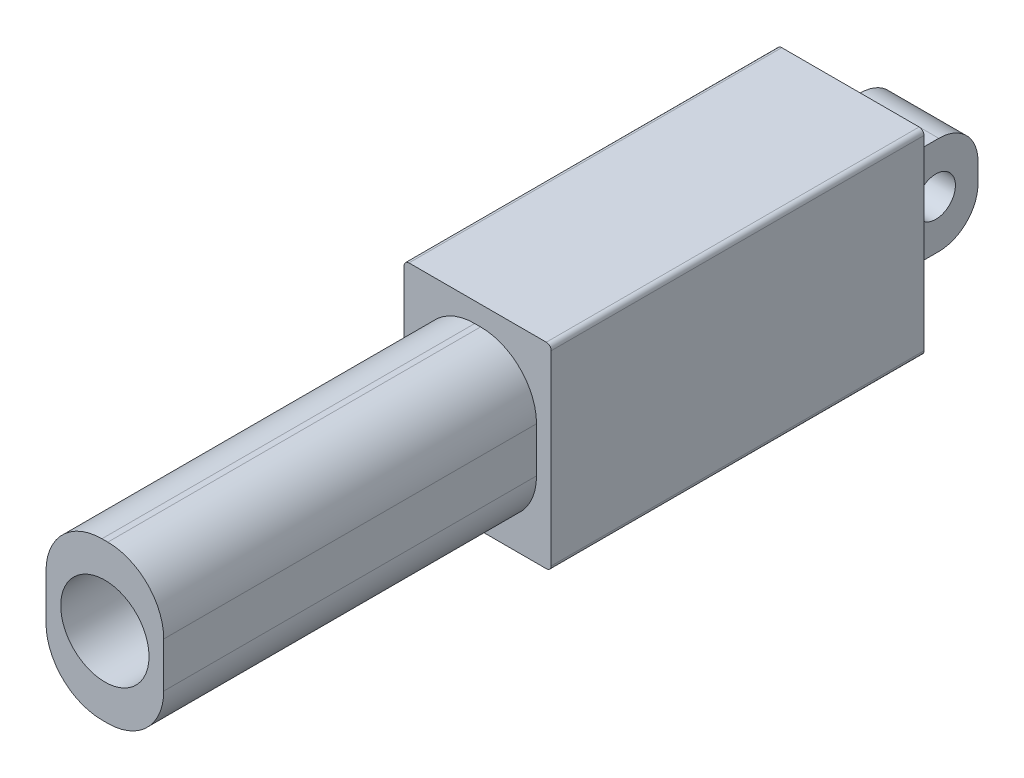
from build123d import *

# Parameters (mm, degrees)
SKETCH_1_W          = 15
SKETCH_1_H          = 20
EXTRUDE_1_DEPTH     = 38
EXTRUDE_2_DEPTH     = 38
SKETCH_3_W          = 8
SKETCH_3_H          = 10
EXTRUDE_3_DEPTH     = 9
FILLET_1_R          = 4
SKETCH_4_R          = 2
CUT_EXTRUDE_1_DEPTH = 78.512902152
FILLET_2_R          = 0.5
SKETCH_5_R          = 4.5
CUT_EXTRUDE_2_DEPTH = 35


with BuildPart() as part:
    # Sketch 1 → Extrude 1 (new body)
    with BuildSketch(Plane.XY):
        Rectangle(SKETCH_1_W, SKETCH_1_H)
    extrude(amount=EXTRUDE_1_DEPTH)

    # Sketch 2 → Extrude 2 (add)
    with BuildSketch(Plane.XY.offset(38)):
        with BuildLine():
            Line((0.3, -8), (-0.3, -8))
            ThreePointArc((-0.3, -8), (-4.330508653, -6.330508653), (-6, -2.3))
            Line((-6, -2.3), (-6, 2.3))
            ThreePointArc((-6, 2.3), (-4.330508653, 6.330508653), (-0.3, 8))
            Line((-0.3, 8), (0.3, 8))
            ThreePointArc((0.3, 8), (4.330508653, 6.330508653), (6, 2.3))
            Line((6, 2.3), (6, -2.3))
            ThreePointArc((6, -2.3), (4.330508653, -6.330508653), (0.3, -8))
        make_face()
    extrude(amount=EXTRUDE_2_DEPTH)

    # Sketch 3 → Extrude 3 (add)
    with BuildSketch(Plane(origin=(0, 0, 0), x_dir=(-1, 0, 0), z_dir=(0, 0, -1))):
        Rectangle(SKETCH_3_W, SKETCH_3_H)
    extrude(amount=EXTRUDE_3_DEPTH)

    # Fillet 1
    fillet_1_edges = [part.edges().sort_by_distance(p)[0] for p in [
        (0, 5, -9),
        (0, -5, -9),
    ]]
    fillet(fillet_1_edges, radius=FILLET_1_R)

    # Sketch 4 → Cut-Extrude 1 (cut, through all)
    with BuildSketch(Plane.ZY.offset(4)):
        with Locations((-4.7, 0)):
            Circle(SKETCH_4_R)
    extrude(amount=-CUT_EXTRUDE_1_DEPTH, mode=Mode.SUBTRACT)

    # Fillet 2
    fillet_2_edges = [part.edges().sort_by_distance(p)[0] for p in [
        (-7.5, 10, 19),
        (7.5, 10, 19),
        (7.5, -10, 19),
        (-7.5, -10, 19),
    ]]
    fillet(fillet_2_edges, radius=FILLET_2_R)

    # Sketch 5 → Cut-Extrude 2 (cut)
    with BuildSketch(Plane.XY.offset(76)):
        Circle(SKETCH_5_R)
    extrude(amount=-CUT_EXTRUDE_2_DEPTH, mode=Mode.SUBTRACT)


solid = part.part
